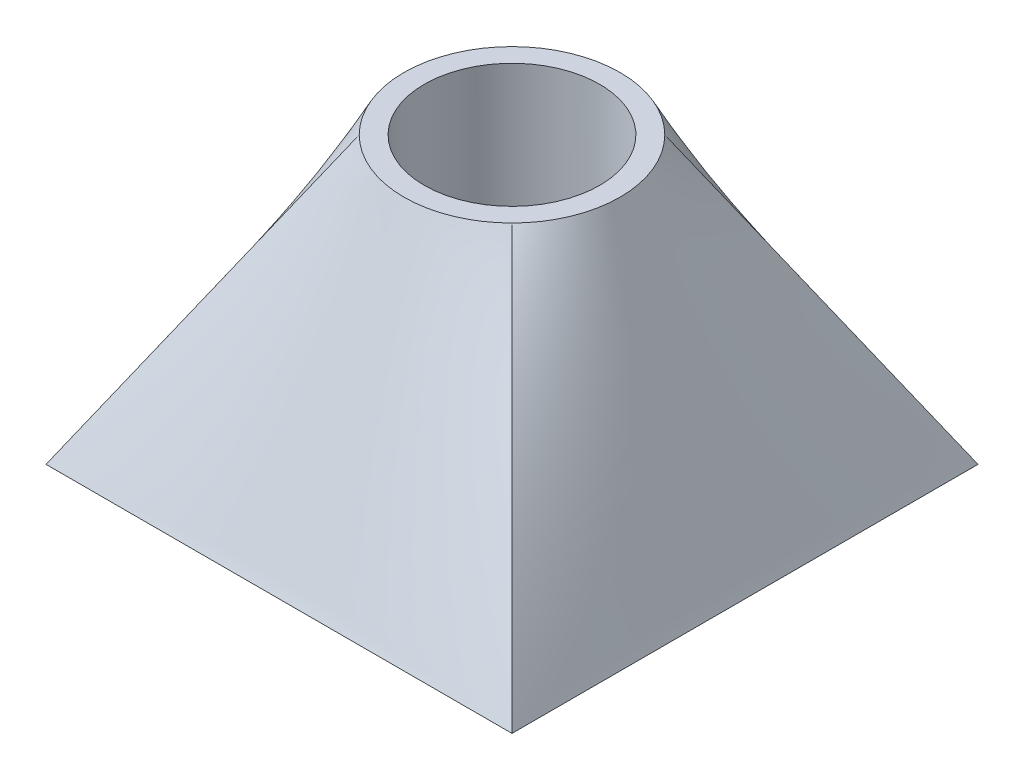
ISO-10303-21;
HEADER;
FILE_DESCRIPTION(('STEP AP214'),'2;1');
FILE_NAME('part.step','',(''),(''),'','','');
FILE_SCHEMA(('AUTOMOTIVE_DESIGN { 1 0 10303 214 1 1 1 1 }'));
ENDSEC;
DATA;
#1=APPLICATION_CONTEXT('core data for automotive mechanical design processes');
#2=APPLICATION_PROTOCOL_DEFINITION('international standard','automotive_design',2000,#1);
#3=PRODUCT_CONTEXT('',#1,'mechanical');
#4=PRODUCT('Part','Part','',(#3));
#5=PRODUCT_RELATED_PRODUCT_CATEGORY('part','',(#4));
#6=PRODUCT_DEFINITION_FORMATION('','',#4);
#7=PRODUCT_DEFINITION_CONTEXT('part definition',#1,'design');
#8=PRODUCT_DEFINITION('design','',#6,#7);
#9=PRODUCT_DEFINITION_SHAPE('','',#8);
#10=(LENGTH_UNIT() NAMED_UNIT(*) SI_UNIT(.MILLI.,.METRE.));
#11=(NAMED_UNIT(*) PLANE_ANGLE_UNIT() SI_UNIT($,.RADIAN.));
#12=(NAMED_UNIT(*) SI_UNIT($,.STERADIAN.) SOLID_ANGLE_UNIT());
#13=UNCERTAINTY_MEASURE_WITH_UNIT(LENGTH_MEASURE(1.E-05),#10,'distance_accuracy_value','');
#14=(GEOMETRIC_REPRESENTATION_CONTEXT(3) GLOBAL_UNCERTAINTY_ASSIGNED_CONTEXT((#13)) GLOBAL_UNIT_ASSIGNED_CONTEXT((#10,
#11,#12)) REPRESENTATION_CONTEXT('',''));
#15=CARTESIAN_POINT('',(0.,0.,0.));
#16=DIRECTION('',(0.,0.,1.));
#17=DIRECTION('',(1.,0.,0.));
#18=AXIS2_PLACEMENT_3D('',#15,#16,#17);
#19=CARTESIAN_POINT('',(0.,70.,0.));
#20=DIRECTION('',(0.,1.,0.));
#21=DIRECTION('',(0.,0.,1.));
#22=AXIS2_PLACEMENT_3D('',#19,#20,#21);
#23=PLANE('',#22);
#24=CARTESIAN_POINT('',(0.,70.,0.));
#25=DIRECTION('',(0.,1.,0.));
#26=DIRECTION('',(0.,0.,1.));
#27=AXIS2_PLACEMENT_3D('',#24,#25,#26);
#28=CIRCLE('',#27,21.5);
#29=CARTESIAN_POINT('',(0.,70.,21.5));
#30=VERTEX_POINT('',#29);
#31=EDGE_CURVE('E294',#30,#30,#28,.T.);
#32=ORIENTED_EDGE('',*,*,#31,.F.);
#33=EDGE_LOOP('',(#32));
#34=FACE_BOUND('',#33,.T.);
#35=CARTESIAN_POINT('',(0.,70.,0.));
#36=DIRECTION('',(0.,1.,0.));
#37=DIRECTION('',(0.,0.,1.));
#38=AXIS2_PLACEMENT_3D('',#35,#36,#37);
#39=CIRCLE('',#38,26.5);
#40=CARTESIAN_POINT('',(-18.7383297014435,70.,-18.7383297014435));
#41=VERTEX_POINT('',#40);
#42=CARTESIAN_POINT('',(-18.7383297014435,70.,18.7383297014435));
#43=VERTEX_POINT('',#42);
#44=EDGE_CURVE('E12',#41,#43,#39,.T.);
#45=ORIENTED_EDGE('',*,*,#44,.T.);
#46=CARTESIAN_POINT('',(0.,70.,0.));
#47=DIRECTION('',(0.,1.,0.));
#48=DIRECTION('',(0.,0.,1.));
#49=AXIS2_PLACEMENT_3D('',#46,#47,#48);
#50=CIRCLE('',#49,26.5);
#51=CARTESIAN_POINT('',(18.7383297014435,70.,18.7383297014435));
#52=VERTEX_POINT('',#51);
#53=EDGE_CURVE('E87',#43,#52,#50,.T.);
#54=ORIENTED_EDGE('',*,*,#53,.T.);
#55=CARTESIAN_POINT('',(0.,70.,0.));
#56=DIRECTION('',(0.,1.,0.));
#57=DIRECTION('',(0.,0.,1.));
#58=AXIS2_PLACEMENT_3D('',#55,#56,#57);
#59=CIRCLE('',#58,26.5);
#60=CARTESIAN_POINT('',(18.7383297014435,70.,-18.7383297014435));
#61=VERTEX_POINT('',#60);
#62=EDGE_CURVE('E159',#52,#61,#59,.T.);
#63=ORIENTED_EDGE('',*,*,#62,.T.);
#64=CARTESIAN_POINT('',(0.,70.,0.));
#65=DIRECTION('',(0.,1.,0.));
#66=DIRECTION('',(0.,0.,1.));
#67=AXIS2_PLACEMENT_3D('',#64,#65,#66);
#68=CIRCLE('',#67,26.5);
#69=EDGE_CURVE('E154',#61,#41,#68,.T.);
#70=ORIENTED_EDGE('',*,*,#69,.T.);
#71=EDGE_LOOP('',(#45,#54,#63,#70));
#72=FACE_BOUND('',#71,.T.);
#73=ADVANCED_FACE('F77',(#34,#72),#23,.T.);
#74=CARTESIAN_POINT('',(0.,0.,0.));
#75=DIRECTION('',(0.,-1.,0.));
#76=DIRECTION('',(0.,0.,-1.));
#77=AXIS2_PLACEMENT_3D('',#74,#75,#76);
#78=PLANE('',#77);
#79=CARTESIAN_POINT('',(0.,0.,0.));
#80=DIRECTION('',(0.,-1.,0.));
#81=DIRECTION('',(0.,0.,-1.));
#82=AXIS2_PLACEMENT_3D('',#79,#80,#81);
#83=CIRCLE('',#82,21.5);
#84=CARTESIAN_POINT('',(0.,0.,-21.5));
#85=VERTEX_POINT('',#84);
#86=EDGE_CURVE('E286',#85,#85,#83,.T.);
#87=ORIENTED_EDGE('',*,*,#86,.F.);
#88=EDGE_LOOP('',(#87));
#89=FACE_BOUND('',#88,.T.);
#90=DIRECTION('',(0.,0.,-1.));
#91=VECTOR('',#90,1.);
#92=CARTESIAN_POINT('',(57.15,0.,57.15));
#93=LINE('',#92,#91);
#94=CARTESIAN_POINT('',(57.15,0.,57.15));
#95=VERTEX_POINT('',#94);
#96=CARTESIAN_POINT('',(57.15,0.,-57.15));
#97=VERTEX_POINT('',#96);
#98=EDGE_CURVE('E147',#95,#97,#93,.T.);
#99=ORIENTED_EDGE('',*,*,#98,.F.);
#100=DIRECTION('',(1.,0.,0.));
#101=VECTOR('',#100,1.);
#102=CARTESIAN_POINT('',(-57.15,0.,57.15));
#103=LINE('',#102,#101);
#104=CARTESIAN_POINT('',(-57.15,0.,57.15));
#105=VERTEX_POINT('',#104);
#106=EDGE_CURVE('E127',#105,#95,#103,.T.);
#107=ORIENTED_EDGE('',*,*,#106,.F.);
#108=DIRECTION('',(0.,0.,1.));
#109=VECTOR('',#108,1.);
#110=CARTESIAN_POINT('',(-57.15,0.,57.15));
#111=LINE('',#110,#109);
#112=CARTESIAN_POINT('',(-57.15,0.,-57.15));
#113=VERTEX_POINT('',#112);
#114=EDGE_CURVE('E118',#113,#105,#111,.T.);
#115=ORIENTED_EDGE('',*,*,#114,.F.);
#116=DIRECTION('',(-1.,0.,0.));
#117=VECTOR('',#116,1.);
#118=CARTESIAN_POINT('',(-57.15,0.,-57.15));
#119=LINE('',#118,#117);
#120=EDGE_CURVE('E123',#97,#113,#119,.T.);
#121=ORIENTED_EDGE('',*,*,#120,.F.);
#122=EDGE_LOOP('',(#99,#107,#115,#121));
#123=FACE_BOUND('',#122,.T.);
#124=ADVANCED_FACE('F122',(#89,#123),#78,.T.);
#125=CARTESIAN_POINT('',(-57.15,0.,57.15));
#126=CARTESIAN_POINT('',(-18.7383297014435,70.,18.7383297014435));
#127=CARTESIAN_POINT('',(-52.3875,0.,57.15));
#128=CARTESIAN_POINT('',(-17.6341630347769,70.,19.8424963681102));
#129=CARTESIAN_POINT('',(-47.625,0.,57.15));
#130=CARTESIAN_POINT('',(-16.3905465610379,70.,20.8897970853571));
#131=CARTESIAN_POINT('',(-38.1,0.,57.15));
#132=CARTESIAN_POINT('',(-13.6410864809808,70.,22.7805706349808));
#133=CARTESIAN_POINT('',(-33.3375,0.,57.15));
#134=CARTESIAN_POINT('',(-12.1351024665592,70.,23.6234312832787));
#135=CARTESIAN_POINT('',(-23.8125,0.,57.15));
#136=CARTESIAN_POINT('',(-8.91529695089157,70.,25.0168882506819));
#137=CARTESIAN_POINT('',(-19.05,0.,57.15));
#138=CARTESIAN_POINT('',(-7.20172753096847,70.,25.5668015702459));
#139=CARTESIAN_POINT('',(-9.52500000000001,0.,57.15));
#140=CARTESIAN_POINT('',(-3.65847461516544,70.,26.3085876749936));
#141=CARTESIAN_POINT('',(-4.76250000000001,0.,57.15));
#142=CARTESIAN_POINT('',(-1.82944323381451,70.,26.5));
#143=CARTESIAN_POINT('',(4.76249999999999,0.,57.15));
#144=CARTESIAN_POINT('',(1.8294432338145,70.,26.5));
#145=CARTESIAN_POINT('',(9.52499999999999,0.,57.15));
#146=CARTESIAN_POINT('',(3.65847461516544,70.,26.3085876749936));
#147=CARTESIAN_POINT('',(19.05,0.,57.15));
#148=CARTESIAN_POINT('',(7.20172753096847,70.,25.5668015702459));
#149=CARTESIAN_POINT('',(23.8125,0.,57.15));
#150=CARTESIAN_POINT('',(8.91529695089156,70.,25.0168882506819));
#151=CARTESIAN_POINT('',(33.3375,0.,57.15));
#152=CARTESIAN_POINT('',(12.1351024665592,70.,23.6234312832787));
#153=CARTESIAN_POINT('',(38.1,0.,57.15));
#154=CARTESIAN_POINT('',(13.6410864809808,70.,22.7805706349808));
#155=CARTESIAN_POINT('',(47.625,0.,57.15));
#156=CARTESIAN_POINT('',(16.3905465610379,70.,20.8897970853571));
#157=CARTESIAN_POINT('',(52.3875,0.,57.15));
#158=CARTESIAN_POINT('',(17.6341630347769,70.,19.8424963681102));
#159=CARTESIAN_POINT('',(57.15,0.,57.15));
#160=CARTESIAN_POINT('',(18.7383297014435,70.,18.7383297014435));
#161=B_SPLINE_SURFACE_WITH_KNOTS('',3,1,((#125,#126),(#127,#128),(#129,#130),(#131,#132),(#133,
#134),(#135,#136),(#137,#138),(#139,#140),(#141,#142),(#143,#144),(#145,#146),(#147,#148),(#149,
#150),(#151,#152),(#153,#154),(#155,#156),(#157,#158),(#159,#160)),.UNSPECIFIED.,.F.,.F.,.F.,(4,
2,2,2,2,2,2,2,4),(2,2),(0.,0.125,0.25,0.375,0.5,0.625,0.75,0.875,1.),(0.,1.),.UNSPECIFIED.);
#162=DIRECTION('',(-0.43351398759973,0.790019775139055,-0.43351398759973));
#163=VECTOR('',#162,1.);
#164=CARTESIAN_POINT('',(37.9441648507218,35.,37.9441648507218));
#165=LINE('',#164,#163);
#166=EDGE_CURVE('E161',#95,#52,#165,.T.);
#167=DIRECTION('',(-0.43351398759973,-0.790019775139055,0.43351398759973));
#168=VECTOR('',#167,1.);
#169=CARTESIAN_POINT('',(-37.9441648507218,35.,37.9441648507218));
#170=LINE('',#169,#168);
#171=EDGE_CURVE('E310',#43,#105,#170,.T.);
#172=ORIENTED_EDGE('',*,*,#106,.T.);
#173=ORIENTED_EDGE('',*,*,#166,.T.);
#174=ORIENTED_EDGE('',*,*,#53,.F.);
#175=ORIENTED_EDGE('',*,*,#171,.T.);
#176=EDGE_LOOP('',(#172,#173,#174,#175));
#177=FACE_BOUND('',#176,.T.);
#178=ADVANCED_FACE('F228',(#177),#161,.T.);
#179=CARTESIAN_POINT('',(57.15,0.,57.15));
#180=CARTESIAN_POINT('',(18.7383297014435,70.,18.7383297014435));
#181=CARTESIAN_POINT('',(57.15,0.,52.3874999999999));
#182=CARTESIAN_POINT('',(19.8424963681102,70.,17.6341630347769));
#183=CARTESIAN_POINT('',(57.15,0.,47.6249999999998));
#184=CARTESIAN_POINT('',(20.8897970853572,70.,16.3905465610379));
#185=CARTESIAN_POINT('',(57.15,0.,38.0999999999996));
#186=CARTESIAN_POINT('',(22.7805706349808,70.,13.6410864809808));
#187=CARTESIAN_POINT('',(57.15,0.,33.3374999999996));
#188=CARTESIAN_POINT('',(23.6234312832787,70.,12.1351024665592));
#189=CARTESIAN_POINT('',(57.15,0.,23.8124999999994));
#190=CARTESIAN_POINT('',(25.0168882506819,70.,8.91529695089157));
#191=CARTESIAN_POINT('',(57.15,0.,19.0499999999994));
#192=CARTESIAN_POINT('',(25.5668015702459,70.,7.20172753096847));
#193=CARTESIAN_POINT('',(57.15,0.,9.52499999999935));
#194=CARTESIAN_POINT('',(26.3085876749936,70.,3.65847461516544));
#195=CARTESIAN_POINT('',(57.15,0.,4.76249999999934));
#196=CARTESIAN_POINT('',(26.5,70.,1.82944323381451));
#197=CARTESIAN_POINT('',(57.15,0.,-4.76250000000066));
#198=CARTESIAN_POINT('',(26.5,70.,-1.8294432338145));
#199=CARTESIAN_POINT('',(57.15,0.,-9.52500000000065));
#200=CARTESIAN_POINT('',(26.3085876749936,70.,-3.65847461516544));
#201=CARTESIAN_POINT('',(57.15,0.,-19.0500000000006));
#202=CARTESIAN_POINT('',(25.5668015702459,70.,-7.20172753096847));
#203=CARTESIAN_POINT('',(57.15,0.,-23.8125000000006));
#204=CARTESIAN_POINT('',(25.0168882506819,70.,-8.91529695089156));
#205=CARTESIAN_POINT('',(57.15,0.,-33.3375000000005));
#206=CARTESIAN_POINT('',(23.6234312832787,70.,-12.1351024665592));
#207=CARTESIAN_POINT('',(57.15,0.,-38.1000000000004));
#208=CARTESIAN_POINT('',(22.7805706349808,70.,-13.6410864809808));
#209=CARTESIAN_POINT('',(57.15,0.,-47.6250000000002));
#210=CARTESIAN_POINT('',(20.8897970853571,70.,-16.3905465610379));
#211=CARTESIAN_POINT('',(57.15,0.,-52.3875000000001));
#212=CARTESIAN_POINT('',(19.8424963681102,70.,-17.6341630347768));
#213=CARTESIAN_POINT('',(57.15,0.,-57.15));
#214=CARTESIAN_POINT('',(18.7383297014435,70.,-18.7383297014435));
#215=B_SPLINE_SURFACE_WITH_KNOTS('',3,1,((#179,#180),(#181,#182),(#183,#184),(#185,#186),(#187,
#188),(#189,#190),(#191,#192),(#193,#194),(#195,#196),(#197,#198),(#199,#200),(#201,#202),(#203,
#204),(#205,#206),(#207,#208),(#209,#210),(#211,#212),(#213,#214)),.UNSPECIFIED.,.F.,.F.,.F.,(4,
2,2,2,2,2,2,2,4),(2,2),(0.,0.125,0.25,0.375,0.5,0.625,0.75,0.875,1.),(0.,1.),.UNSPECIFIED.);
#216=DIRECTION('',(-0.43351398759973,0.790019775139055,0.43351398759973));
#217=VECTOR('',#216,1.);
#218=CARTESIAN_POINT('',(37.9441648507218,35.,-37.9441648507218));
#219=LINE('',#218,#217);
#220=EDGE_CURVE('E145',#97,#61,#219,.T.);
#221=ORIENTED_EDGE('',*,*,#98,.T.);
#222=ORIENTED_EDGE('',*,*,#220,.T.);
#223=ORIENTED_EDGE('',*,*,#62,.F.);
#224=ORIENTED_EDGE('',*,*,#166,.F.);
#225=EDGE_LOOP('',(#221,#222,#223,#224));
#226=FACE_BOUND('',#225,.T.);
#227=ADVANCED_FACE('F183',(#226),#215,.T.);
#228=CARTESIAN_POINT('',(-57.15,0.,-57.15));
#229=CARTESIAN_POINT('',(-18.7383297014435,70.,-18.7383297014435));
#230=CARTESIAN_POINT('',(-57.15,0.,-52.3875));
#231=CARTESIAN_POINT('',(-19.8424963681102,70.,-17.6341630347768));
#232=CARTESIAN_POINT('',(-57.15,0.,-47.625));
#233=CARTESIAN_POINT('',(-20.8897970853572,70.,-16.3905465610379));
#234=CARTESIAN_POINT('',(-57.15,0.,-38.1));
#235=CARTESIAN_POINT('',(-22.7805706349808,70.,-13.6410864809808));
#236=CARTESIAN_POINT('',(-57.15,0.,-33.3375));
#237=CARTESIAN_POINT('',(-23.6234312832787,70.,-12.1351024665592));
#238=CARTESIAN_POINT('',(-57.15,0.,-23.8125));
#239=CARTESIAN_POINT('',(-25.0168882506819,70.,-8.91529695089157));
#240=CARTESIAN_POINT('',(-57.15,0.,-19.05));
#241=CARTESIAN_POINT('',(-25.5668015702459,70.,-7.20172753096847));
#242=CARTESIAN_POINT('',(-57.15,0.,-9.52499999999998));
#243=CARTESIAN_POINT('',(-26.3085876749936,70.,-3.65847461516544));
#244=CARTESIAN_POINT('',(-57.15,0.,-4.76249999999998));
#245=CARTESIAN_POINT('',(-26.5,70.,-1.82944323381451));
#246=CARTESIAN_POINT('',(-57.15,0.,4.76250000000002));
#247=CARTESIAN_POINT('',(-26.5,70.,1.8294432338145));
#248=CARTESIAN_POINT('',(-57.15,0.,9.52500000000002));
#249=CARTESIAN_POINT('',(-26.3085876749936,70.,3.65847461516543));
#250=CARTESIAN_POINT('',(-57.15,0.,19.05));
#251=CARTESIAN_POINT('',(-25.5668015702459,70.,7.20172753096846));
#252=CARTESIAN_POINT('',(-57.15,0.,23.8125));
#253=CARTESIAN_POINT('',(-25.0168882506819,70.,8.91529695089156));
#254=CARTESIAN_POINT('',(-57.15,0.,33.3375));
#255=CARTESIAN_POINT('',(-23.6234312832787,70.,12.1351024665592));
#256=CARTESIAN_POINT('',(-57.15,0.,38.1));
#257=CARTESIAN_POINT('',(-22.7805706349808,70.,13.6410864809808));
#258=CARTESIAN_POINT('',(-57.15,0.,47.625));
#259=CARTESIAN_POINT('',(-20.8897970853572,70.,16.3905465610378));
#260=CARTESIAN_POINT('',(-57.15,0.,52.3875));
#261=CARTESIAN_POINT('',(-19.8424963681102,70.,17.6341630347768));
#262=CARTESIAN_POINT('',(-57.15,0.,57.15));
#263=CARTESIAN_POINT('',(-18.7383297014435,70.,18.7383297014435));
#264=B_SPLINE_SURFACE_WITH_KNOTS('',3,1,((#228,#229),(#230,#231),(#232,#233),(#234,#235),(#236,
#237),(#238,#239),(#240,#241),(#242,#243),(#244,#245),(#246,#247),(#248,#249),(#250,#251),(#252,
#253),(#254,#255),(#256,#257),(#258,#259),(#260,#261),(#262,#263)),.UNSPECIFIED.,.F.,.F.,.F.,(4,
2,2,2,2,2,2,2,4),(2,2),(0.,0.125,0.25,0.375,0.5,0.625,0.75,0.875,1.),(0.,1.),.UNSPECIFIED.);
#265=DIRECTION('',(0.43351398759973,0.790019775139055,0.43351398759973));
#266=VECTOR('',#265,1.);
#267=CARTESIAN_POINT('',(-37.9441648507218,35.,-37.9441648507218));
#268=LINE('',#267,#266);
#269=EDGE_CURVE('E143',#113,#41,#268,.T.);
#270=ORIENTED_EDGE('',*,*,#114,.T.);
#271=ORIENTED_EDGE('',*,*,#171,.F.);
#272=ORIENTED_EDGE('',*,*,#44,.F.);
#273=ORIENTED_EDGE('',*,*,#269,.F.);
#274=EDGE_LOOP('',(#270,#271,#272,#273));
#275=FACE_BOUND('',#274,.T.);
#276=ADVANCED_FACE('F151',(#275),#264,.T.);
#277=CARTESIAN_POINT('',(57.15,0.,-57.15));
#278=CARTESIAN_POINT('',(18.7383297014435,70.,-18.7383297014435));
#279=CARTESIAN_POINT('',(52.3875,0.,-57.15));
#280=CARTESIAN_POINT('',(17.6341630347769,70.,-19.8424963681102));
#281=CARTESIAN_POINT('',(47.6249999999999,0.,-57.15));
#282=CARTESIAN_POINT('',(16.3905465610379,70.,-20.8897970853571));
#283=CARTESIAN_POINT('',(38.0999999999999,0.,-57.15));
#284=CARTESIAN_POINT('',(13.6410864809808,70.,-22.7805706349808));
#285=CARTESIAN_POINT('',(33.3374999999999,0.,-57.15));
#286=CARTESIAN_POINT('',(12.1351024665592,70.,-23.6234312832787));
#287=CARTESIAN_POINT('',(23.8124999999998,0.,-57.15));
#288=CARTESIAN_POINT('',(8.91529695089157,70.,-25.0168882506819));
#289=CARTESIAN_POINT('',(19.0499999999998,0.,-57.15));
#290=CARTESIAN_POINT('',(7.20172753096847,70.,-25.5668015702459));
#291=CARTESIAN_POINT('',(9.5249999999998,0.,-57.15));
#292=CARTESIAN_POINT('',(3.65847461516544,70.,-26.3085876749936));
#293=CARTESIAN_POINT('',(4.76249999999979,0.,-57.15));
#294=CARTESIAN_POINT('',(1.82944323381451,70.,-26.5));
#295=CARTESIAN_POINT('',(-4.76250000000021,0.,-57.15));
#296=CARTESIAN_POINT('',(-1.8294432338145,70.,-26.5));
#297=CARTESIAN_POINT('',(-9.52500000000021,0.,-57.15));
#298=CARTESIAN_POINT('',(-3.65847461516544,70.,-26.3085876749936));
#299=CARTESIAN_POINT('',(-19.0500000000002,0.,-57.15));
#300=CARTESIAN_POINT('',(-7.20172753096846,70.,-25.5668015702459));
#301=CARTESIAN_POINT('',(-23.8125000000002,0.,-57.15));
#302=CARTESIAN_POINT('',(-8.91529695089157,70.,-25.0168882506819));
#303=CARTESIAN_POINT('',(-33.3375000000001,0.,-57.15));
#304=CARTESIAN_POINT('',(-12.1351024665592,70.,-23.6234312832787));
#305=CARTESIAN_POINT('',(-38.1000000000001,0.,-57.15));
#306=CARTESIAN_POINT('',(-13.6410864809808,70.,-22.7805706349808));
#307=CARTESIAN_POINT('',(-47.6250000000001,0.,-57.15));
#308=CARTESIAN_POINT('',(-16.3905465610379,70.,-20.8897970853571));
#309=CARTESIAN_POINT('',(-52.3875,0.,-57.15));
#310=CARTESIAN_POINT('',(-17.6341630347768,70.,-19.8424963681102));
#311=CARTESIAN_POINT('',(-57.15,0.,-57.15));
#312=CARTESIAN_POINT('',(-18.7383297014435,70.,-18.7383297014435));
#313=B_SPLINE_SURFACE_WITH_KNOTS('',3,1,((#277,#278),(#279,#280),(#281,#282),(#283,#284),(#285,
#286),(#287,#288),(#289,#290),(#291,#292),(#293,#294),(#295,#296),(#297,#298),(#299,#300),(#301,
#302),(#303,#304),(#305,#306),(#307,#308),(#309,#310),(#311,#312)),.UNSPECIFIED.,.F.,.F.,.F.,(4,
2,2,2,2,2,2,2,4),(2,2),(0.,0.125,0.25,0.375,0.5,0.625,0.75,0.875,1.),(0.,1.),.UNSPECIFIED.);
#314=ORIENTED_EDGE('',*,*,#120,.T.);
#315=ORIENTED_EDGE('',*,*,#269,.T.);
#316=ORIENTED_EDGE('',*,*,#69,.F.);
#317=ORIENTED_EDGE('',*,*,#220,.F.);
#318=EDGE_LOOP('',(#314,#315,#316,#317));
#319=FACE_BOUND('',#318,.T.);
#320=ADVANCED_FACE('F141',(#319),#313,.T.);
#321=CARTESIAN_POINT('',(0.,-0.00464033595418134,0.));
#322=DIRECTION('',(0.,1.,0.));
#323=DIRECTION('',(0.,0.,1.));
#324=AXIS2_PLACEMENT_3D('',#321,#322,#323);
#325=CYLINDRICAL_SURFACE('',#324,21.5);
#326=ORIENTED_EDGE('',*,*,#86,.T.);
#327=EDGE_LOOP('',(#326));
#328=FACE_BOUND('',#327,.T.);
#329=ORIENTED_EDGE('',*,*,#31,.T.);
#330=EDGE_LOOP('',(#329));
#331=FACE_BOUND('',#330,.T.);
#332=ADVANCED_FACE('F230',(#328,#331),#325,.F.);
#333=CLOSED_SHELL('',(#73,#124,#178,#227,#276,#320,#332));
#334=MANIFOLD_SOLID_BREP('B2',#333);
#335=ADVANCED_BREP_SHAPE_REPRESENTATION('',(#18,#334),#14);
#336=SHAPE_DEFINITION_REPRESENTATION(#9,#335);
ENDSEC;
END-ISO-10303-21;
